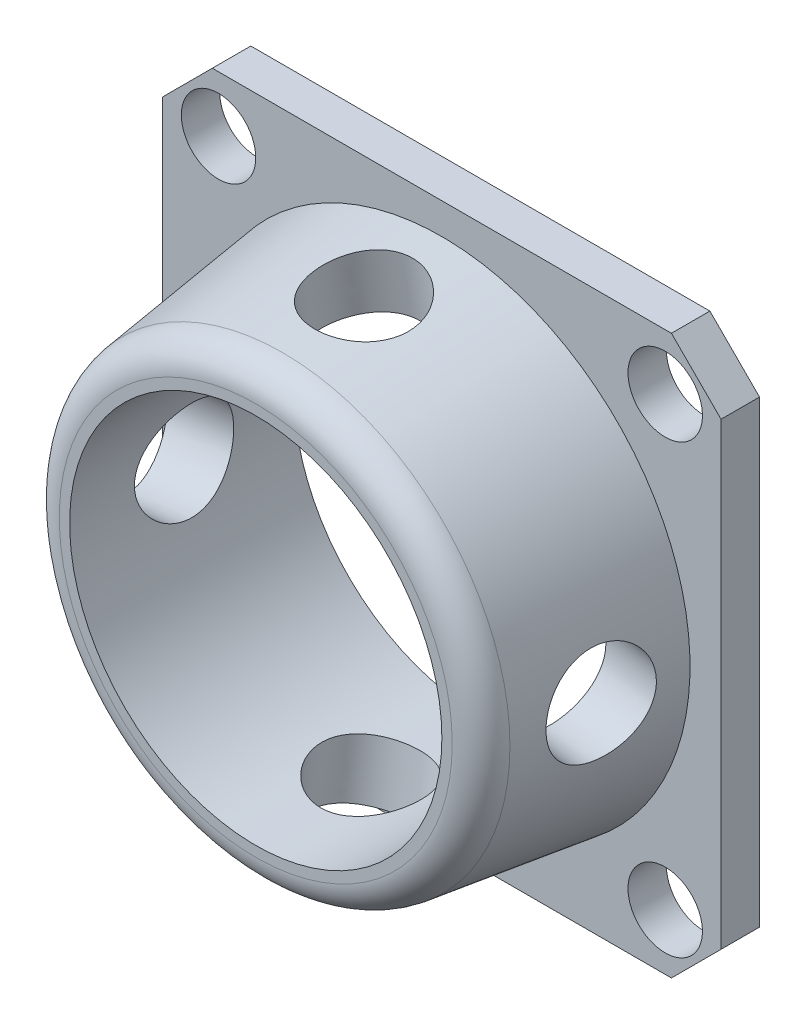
from build123d import *

# Parameters (mm, degrees)
CROQUIS1_R                 = 3
SALIENTE_EXTRUIR1_DEPTH    = 3.1
CORTAR_EXTRUIR1_DEPTH      = 32.970455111
CORTAR_EXTRUIR1_DEPTH_BACK = 32.970455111
CROQUIS2_R                 = 15
CROQUIS3_R                 = 20
SALIENTE_EXTRUIR2_DEPTH    = 15
SALIENTE_EXTRUIR2_TAPER    = 7.5
CORTAR_EXTRUIR2_START      = 15
CROQUIS2_2_R               = 15
CORTAR_EXTRUIR2_DEPTH      = 15
REDONDEO1_R                = 2.5
CROQUIS4_R                 = 4
CROQUIS6_R                 = 4


with BuildPart() as part:
    # Croquis1 → Saliente-Extruir1 (new body)
    with BuildSketch(Plane.XY):
        Polygon((-18.5, -22.5), (18.5, -22.5), (22.5, -18.5), (22.5, 18.5), (18.5, 22.5), (-18.5, 22.5), (-22.5, 18.5), (-22.5, -18.5), align=None)
        with Locations(Location((18, 18, 0), (0, 0, 180))):
            Circle(CROQUIS1_R, mode=Mode.SUBTRACT)
        with Locations(Location((-18, 18, 0), (0, 0, 180))):
            Circle(CROQUIS1_R, mode=Mode.SUBTRACT)
        with Locations(Location((18, -18, 0), (0, 0, 180))):
            Circle(CROQUIS1_R, mode=Mode.SUBTRACT)
        with Locations(Location((-18, -18, 0), (0, 0, 180))):
            Circle(CROQUIS1_R, mode=Mode.SUBTRACT)
    extrude(amount=SALIENTE_EXTRUIR1_DEPTH)

    # Croquis2 → Cortar-Extruir1 (cut, two sides: drawn at the far end of the back side and taken through both)
    with BuildSketch(Plane.XY.offset(3.1).offset(-CORTAR_EXTRUIR1_DEPTH_BACK)):
        Circle(CROQUIS2_R)
    extrude(amount=CORTAR_EXTRUIR1_DEPTH + CORTAR_EXTRUIR1_DEPTH_BACK, mode=Mode.SUBTRACT)

    # Croquis3 → Saliente-Extruir2 (add)
    with BuildSketch(Plane.XY.offset(3.1)):
        Circle(CROQUIS3_R)
    extrude(amount=SALIENTE_EXTRUIR2_DEPTH, taper=SALIENTE_EXTRUIR2_TAPER)

    # Croquis2_2 → Cortar-Extruir2 (cut)
    with BuildSketch(Plane.XY.offset(3.1).offset(CORTAR_EXTRUIR2_START)):
        Circle(CROQUIS2_2_R)
    extrude(amount=-CORTAR_EXTRUIR2_DEPTH, mode=Mode.SUBTRACT)

    # Redondeo1
    redondeo1_edges = [part.edges().sort_by_distance(p)[0] for p in [
        (-18.025212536, 0, 18.1),
    ]]
    fillet(redondeo1_edges, radius=REDONDEO1_R)

    # Cortar-Barrer1: sweep along a path in Croquis5
    with BuildLine(Plane(origin=(0, 0, 0), x_dir=(0, 0, -1), z_dir=(1, 0, 0))) as cortar_barrer1_path:
        Line((-9.51315774, -20), (-7.562833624, -5.18581757))
    # Croquis4 → Cortar-Barrer1 (sweep, cut)
    with BuildSketch(Plane(origin=(0, -20, 0), x_dir=(1, 0, 0), z_dir=(0, 1, 0))):
        with Locations((0, -9.51315774)):
            Circle(CROQUIS4_R)
    cortar_barrer1 = sweep(path=cortar_barrer1_path.line, mode=Mode.SUBTRACT)

    # Simetr_a1: Cortar-Barrer1 across plane
    add(cortar_barrer1.mirror(Plane.ZX), mode=Mode.SUBTRACT)

    # Cortar-Barrer2: sweep along a path in Croquis7
    with BuildLine(Plane(origin=(0, 0, 0), x_dir=(1, 0, 0), z_dir=(0, 1, 0))) as cortar_barrer2_path:
        Line((20, -9.536753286), (-0.407262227, -6.850086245))
    # Croquis6 → Cortar-Barrer2 (sweep, cut)
    with BuildSketch(Plane(origin=(20, 0, 0), x_dir=(0, 0, -1), z_dir=(1, 0, 0))):
        with Locations((-9.536753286, 0)):
            Circle(CROQUIS6_R)
    cortar_barrer2 = sweep(path=cortar_barrer2_path.line, mode=Mode.SUBTRACT)

    # Simetr_a2: Cortar-Barrer2 across plane
    add(cortar_barrer2.mirror(Plane(origin=(0, 0, 0), x_dir=(0, 0, 1), z_dir=(1, 0, 0))), mode=Mode.SUBTRACT)


solid = part.part
